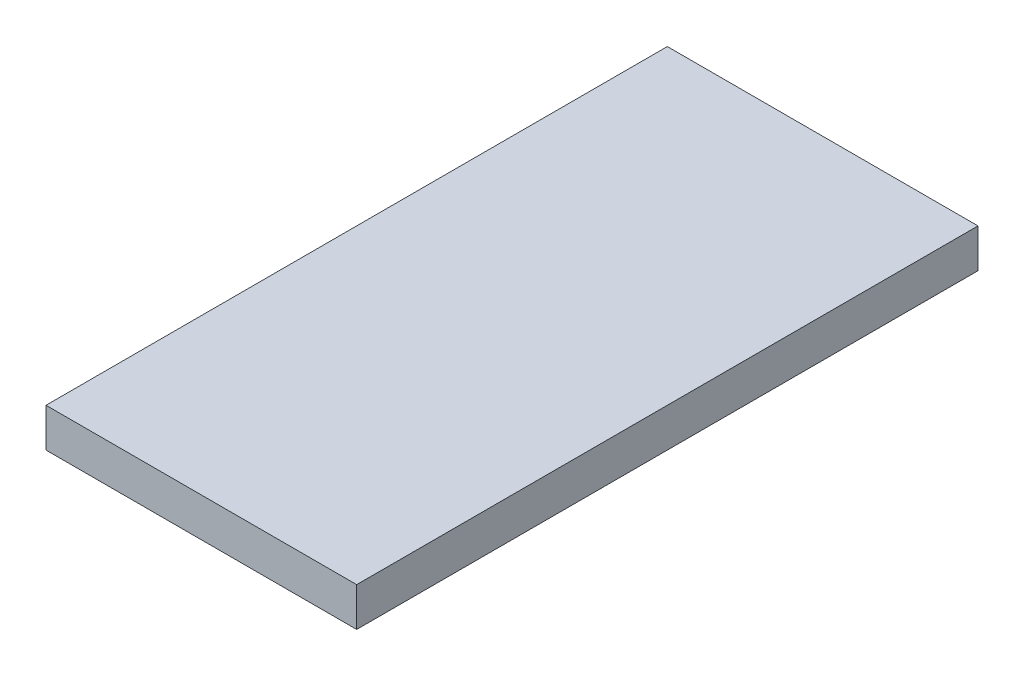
from build123d import *

# Parameters (mm, degrees)
ESQUISSE1_W          = 200
ESQUISSE1_H          = 25
BASE_EXTRUSION_DEPTH = 200


with BuildPart() as part:
    # Esquisse1 → Base-Extrusion (new, symmetric)
    with BuildSketch(Plane.XY):
        with Locations((0, 12.5)):
            Rectangle(ESQUISSE1_W, ESQUISSE1_H)
    extrude(amount=BASE_EXTRUSION_DEPTH, both=True)


solid = part.part
